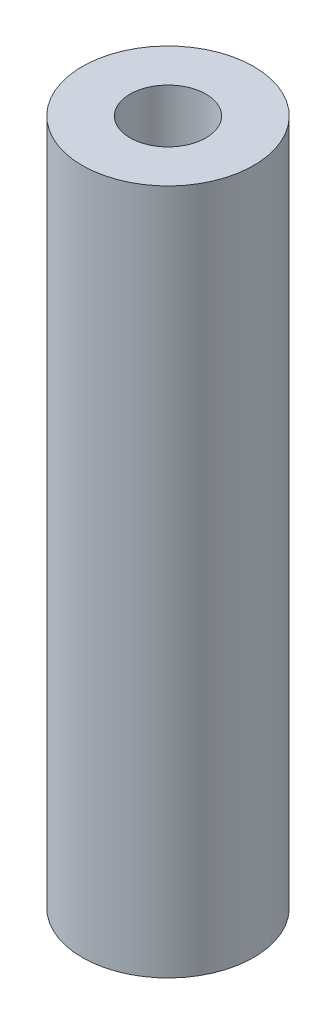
from build123d import *

# Parameters (mm, degrees)
SKETCH1_R          = 4.7625
EXTRUDE1_DEPTH     = 38.1
SKETCH2_R          = 2.1082
CUT_EXTRUDE2_DEPTH = 39.690732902


with BuildPart() as part:
    # Sketch1 → Extrude1 (new body)
    with BuildSketch(Plane(origin=(0, 0, 0), x_dir=(1, 0, 0), z_dir=(0, 1, 0))):
        with Locations(Location((0, 0, 0), (0, 0, 90))):
            Circle(SKETCH1_R)
    extrude(amount=EXTRUDE1_DEPTH)

    # Sketch2 → Cut-Extrude2 (cut, through all)
    with BuildSketch(Plane(origin=(0, 0, 0), x_dir=(1, 0, 0), z_dir=(0, 1, 0))):
        with Locations(Location((0, 0, 0), (0, 0, 90))):
            Circle(SKETCH2_R)
    extrude(amount=CUT_EXTRUDE2_DEPTH, mode=Mode.SUBTRACT)


solid = part.part
